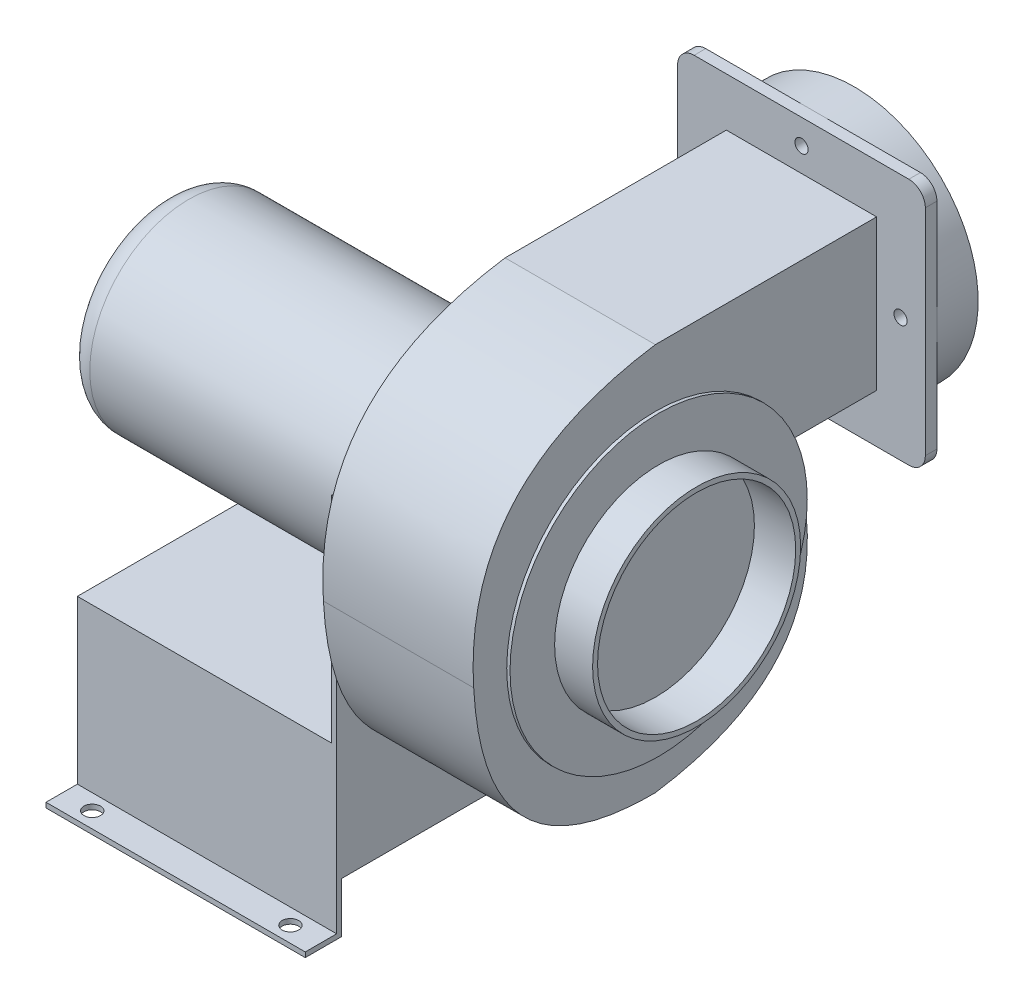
from build123d import *

# Parameters (mm, degrees)
EXTRUDE_1_DEPTH     = 91
EXTRUDE_2_DEPTH     = 7
SKETCH_4_R          = 4
CUT_EXTRUDE_1_DEPTH = 7
SKETCH_5_W          = 90
SKETCH_5_H          = 90
CUT_EXTRUDE_2_DEPTH = 120
SKETCH_6_R          = 75
SKETCH_6_R_2        = 72
EXTRUDE_3_DEPTH     = 25
SKETCH_7_R          = 90
SKETCH_7_R_2        = 60
EXTRUDE_4_DEPTH     = 2
SKETCH_8_R          = 63
SKETCH_8_R_2        = 60
EXTRUDE_5_DEPTH     = 23
EXTRUDE_START       = 206.5
SKETCH_9_R          = 60
EXTRUDE_6_DEPTH     = 206.5
FILLET_1_R          = 15
EXTRUDE_START_2     = 3
EXTRUDE_7_DEPTH     = 3
SKETCH_14_W         = 204
SKETCH_14_H         = 3
EXTRUDE_10_DEPTH    = 154
SKETCH_20_W         = 154
SKETCH_20_H         = 3
EXTRUDE_14_DEPTH    = 68
SKETCH_23_W         = 157
SKETCH_23_H         = 3
EXTRUDE_15_DEPTH    = 27.5
SKETCH_24_W         = 157
SKETCH_24_H         = 22
EXTRUDE_16_DEPTH    = 3
SKETCH_29_R         = 5
CUT_EXTRUDE_3_DEPTH = 3


with BuildPart() as part:
    # Sketch 1 → Extrude 1 (new body)
    with BuildSketch(Plane(origin=(0, 0, 0), x_dir=(0, 0, -1), z_dir=(1, 0, 0))):
        with BuildLine():
            Line((0, 125), (134, 125))
            Line((134, 125), (134, 34))
            Line((134, 34), (83.330666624, 34))
            ThreePointArc((83.330666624, 34), (88.316929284, 17.323971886), (90, 0))
            add(Edge.make_bspline(
                [(0, -110), (105.835605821, -94.311276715), (90, 0)],
                knots=[0, 0, 0, 1, 1, 1], degree=2))
            add(Edge.make_bspline(
                [(-110, 0), (-103.950024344, -110.876866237), (0, -110)],
                knots=[0, 0, 0, 1, 1, 1], degree=2))
            add(Edge.make_bspline(
                [(0, 125), (-116.646299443, 107.475251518), (-110, 0)],
                knots=[0, 0, 0, 1, 1, 1], degree=2))
        make_face()
    extrude(amount=EXTRUDE_1_DEPTH)

    # Sketch 3 → Extrude 2 (add)
    with BuildSketch(Plane(origin=(0, 0, -134), x_dir=(-1, 0, 0), z_dir=(0, 0, -1))):
        with BuildLine():
            Line((-110.5, 4.5), (19.5, 4.5))
            ThreePointArc((19.5, 4.5), (26.571067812, 7.428932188), (29.5, 14.5))
            Line((29.5, 14.5), (29.5, 144.5))
            ThreePointArc((29.5, 144.5), (26.571067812, 151.571067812), (19.5, 154.5))
            Line((19.5, 154.5), (-110.5, 154.5))
            ThreePointArc((-110.5, 154.5), (-117.571067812, 151.571067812), (-120.5, 144.5))
            Line((-120.5, 144.5), (-120.5, 14.5))
            ThreePointArc((-120.5, 14.5), (-117.571067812, 7.428932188), (-110.5, 4.5))
        make_face()
    extrude(amount=EXTRUDE_2_DEPTH)

    # Sketch 4 → Cut-Extrude 1 (cut)
    with BuildSketch(Plane(origin=(0, 0, -141), x_dir=(-1, 0, 0), z_dir=(0, 0, -1))):
        with Locations((-45.5, 139.5)):
            Circle(SKETCH_4_R)
        with Locations((14.5, 79.5)):
            Circle(SKETCH_4_R)
        with Locations((-45.5, 19.5)):
            Circle(SKETCH_4_R)
        with Locations((-105.5, 79.5)):
            Circle(SKETCH_4_R)
    extrude(amount=-CUT_EXTRUDE_1_DEPTH, mode=Mode.SUBTRACT)

    # Sketch 5 → Cut-Extrude 2 (cut)
    with BuildSketch(Plane(origin=(0, 0, -141), x_dir=(-1, 0, 0), z_dir=(0, 0, -1))):
        with Locations((-45.5, 79.5)):
            Rectangle(SKETCH_5_W, SKETCH_5_H)
    extrude(amount=-CUT_EXTRUDE_2_DEPTH, mode=Mode.SUBTRACT)

    # Sketch 6 → Extrude 3 (add)
    with BuildSketch(Plane(origin=(0, 0, -141), x_dir=(-1, 0, 0), z_dir=(0, 0, -1))):
        with Locations((-45.5, 79.5)):
            Circle(SKETCH_6_R)
        with Locations((-45.5, 79.5)):
            Circle(SKETCH_6_R_2, mode=Mode.SUBTRACT)
    extrude(amount=EXTRUDE_3_DEPTH)

    # Sketch 7 → Extrude 4 (add)
    with BuildSketch(Plane(origin=(91, 0, 0), x_dir=(0, 0, -1), z_dir=(1, 0, 0))):
        Circle(SKETCH_7_R)
        Circle(SKETCH_7_R_2, mode=Mode.SUBTRACT)
    extrude(amount=EXTRUDE_4_DEPTH)

    # Sketch 8 → Extrude 5 (add)
    with BuildSketch(Plane(origin=(93, 0, 0), x_dir=(0, 0, -1), z_dir=(1, 0, 0))):
        Circle(SKETCH_8_R)
        Circle(SKETCH_8_R_2, mode=Mode.SUBTRACT)
    extrude(amount=EXTRUDE_5_DEPTH)

    # Sketch 9 → Extrude 6 (add)
    with BuildSketch(Plane.ZY.offset(EXTRUDE_START)):
        with Locations(Location((0, 0, 0), (0, 0, 180))):
            Circle(SKETCH_9_R)
    extrude(amount=-EXTRUDE_6_DEPTH)

    # Fillet 1
    fillet_1_edges = [part.edges().sort_by_distance(p)[0] for p in [
        (-206.5, 0, 60),
    ]]
    fillet(fillet_1_edges, radius=FILLET_1_R)

    # Sketch 11 → Extrude 7 (add)
    with BuildSketch(Plane.ZY.offset(EXTRUDE_START_2)):
        with BuildLine():
            Line((-102, 50), (-33.166247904, 50))
            ThreePointArc((-33.166247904, 50), (0, -60), (33.166247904, 50))
            Line((33.166247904, 50), (102, 50))
            Line((102, 50), (102, -151))
            Line((102, -151), (-102, -151))
            Line((-102, -151), (-102, 50))
        make_face()
    extrude(amount=-EXTRUDE_7_DEPTH)

    # Sketch 14 → Extrude 10 (add)
    with BuildSketch(Plane.ZY.offset(3)):
        with Locations((0, -81.5)):
            Rectangle(SKETCH_14_W, SKETCH_14_H)
    extrude(amount=EXTRUDE_10_DEPTH)

    # Sketch 20 → Extrude 14 (add)
    with BuildSketch(Plane.XZ.offset(83)):
        with Locations((-80, 100.5)):
            Rectangle(SKETCH_20_W, SKETCH_20_H)
        with Locations((-80, -100.5)):
            Rectangle(SKETCH_20_W, SKETCH_20_H)
    extrude(amount=EXTRUDE_14_DEPTH)

    # Sketch 23 → Extrude 15 (add)
    with BuildSketch(Plane(origin=(0, -151, 0), x_dir=(-1, 0, 0), z_dir=(0, -1, 0))):
        with Locations((78.5, -100.5)):
            Rectangle(SKETCH_23_W, SKETCH_23_H)
        with Locations((78.5, 100.5)):
            Rectangle(SKETCH_23_W, SKETCH_23_H)
    extrude(amount=EXTRUDE_15_DEPTH)

    # Sketch 24 → Extrude 16 (add)
    with BuildSketch(Plane.XZ.offset(178.5)):
        with Locations((-78.5, 110)):
            Rectangle(SKETCH_24_W, SKETCH_24_H)
        with Locations((-78.5, -110)):
            Rectangle(SKETCH_24_W, SKETCH_24_H)
    extrude(amount=EXTRUDE_16_DEPTH)

    # Sketch 29 → Cut-Extrude 3 (cut)
    with BuildSketch(Plane.XZ.offset(181.5)):
        with Locations(Location((-138.5, 111.5, 0), (0, 0, 270))):
            Circle(SKETCH_29_R)
        with Locations(Location((-18.5, 111.5, 0), (0, 0, 270))):
            Circle(SKETCH_29_R)
        with Locations(Location((-18.5, -111.5, 0), (0, 0, 270))):
            Circle(SKETCH_29_R)
        with Locations(Location((-138.5, -111.5, 0), (0, 0, 270))):
            Circle(SKETCH_29_R)
    extrude(amount=-CUT_EXTRUDE_3_DEPTH, mode=Mode.SUBTRACT)


solid = part.part
